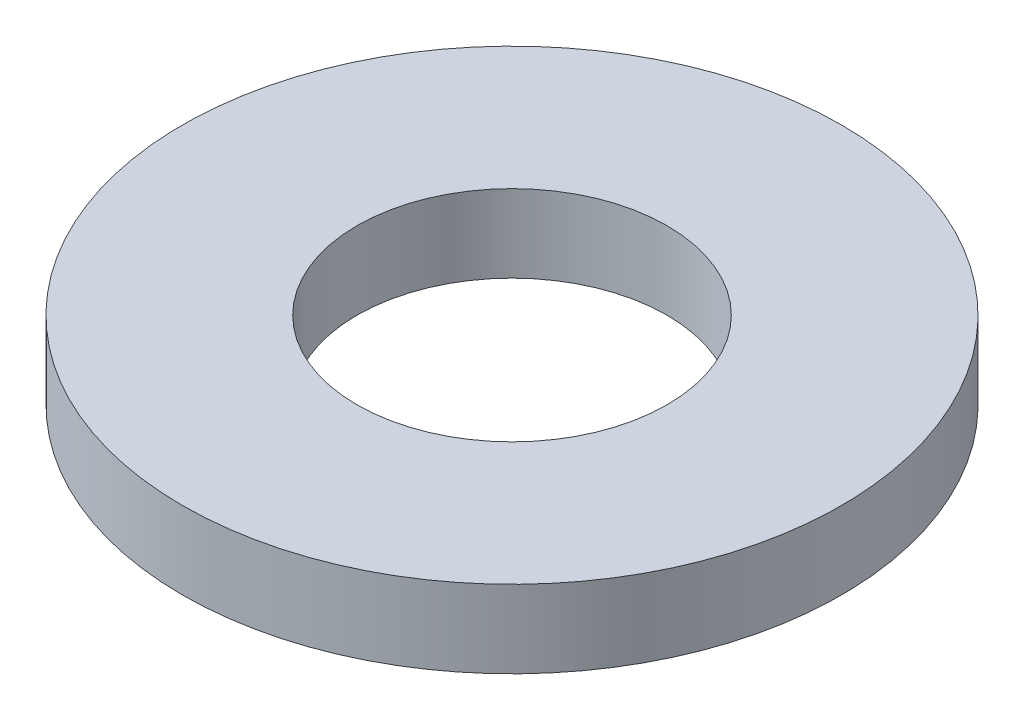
from build123d import *

# Parameters (mm, degrees)
SKETCH_1_R      = 4.25
SKETCH_1_R_2    = 2
EXTRUDE_1_DEPTH = 1


with BuildPart() as part:
    # Sketch 1 → Extrude 1 (new body)
    with BuildSketch(Plane(origin=(0, 0, 0), x_dir=(1, 0, 0), z_dir=(0, 1, 0))):
        with Locations(Location((0, 0, 0), (0, 0, 270))):
            Circle(SKETCH_1_R)
        with Locations(Location((0, 0, 0), (0, 0, 270))):
            Circle(SKETCH_1_R_2, mode=Mode.SUBTRACT)
    extrude(amount=EXTRUDE_1_DEPTH)


solid = part.part
